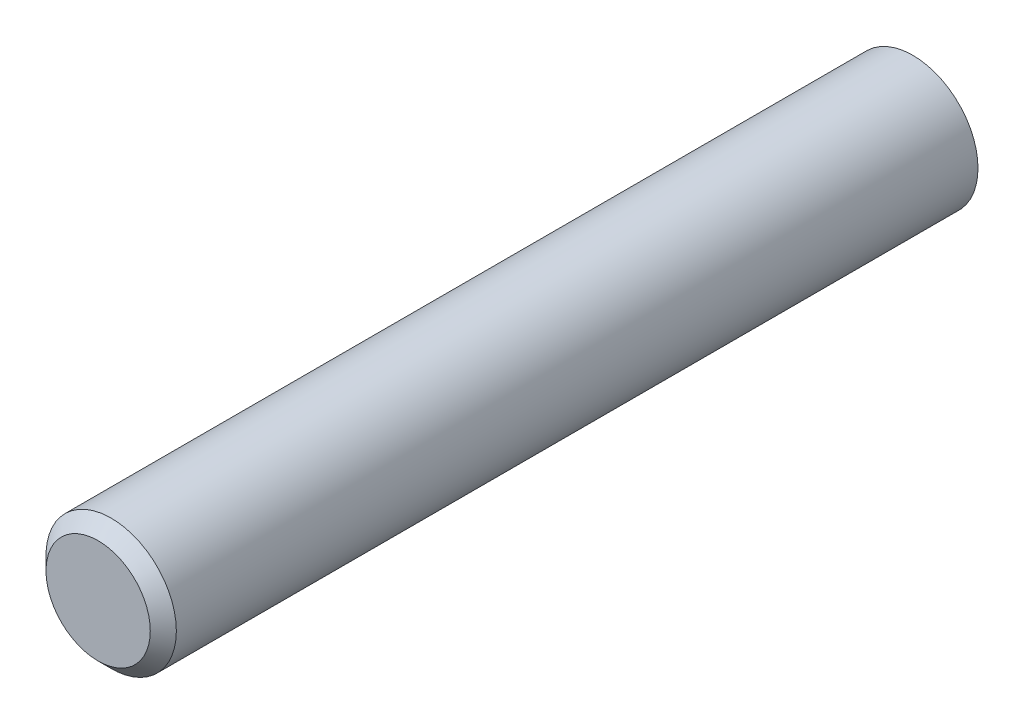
ISO-10303-21;
HEADER;
FILE_DESCRIPTION(('STEP AP214'),'2;1');
FILE_NAME('part.step','',(''),(''),'','','');
FILE_SCHEMA(('AUTOMOTIVE_DESIGN { 1 0 10303 214 1 1 1 1 }'));
ENDSEC;
DATA;
#1=APPLICATION_CONTEXT('core data for automotive mechanical design processes');
#2=APPLICATION_PROTOCOL_DEFINITION('international standard','automotive_design',2000,#1);
#3=PRODUCT_CONTEXT('',#1,'mechanical');
#4=PRODUCT('Part','Part','',(#3));
#5=PRODUCT_RELATED_PRODUCT_CATEGORY('part','',(#4));
#6=PRODUCT_DEFINITION_FORMATION('','',#4);
#7=PRODUCT_DEFINITION_CONTEXT('part definition',#1,'design');
#8=PRODUCT_DEFINITION('design','',#6,#7);
#9=PRODUCT_DEFINITION_SHAPE('','',#8);
#10=(LENGTH_UNIT() NAMED_UNIT(*) SI_UNIT(.MILLI.,.METRE.));
#11=(NAMED_UNIT(*) PLANE_ANGLE_UNIT() SI_UNIT($,.RADIAN.));
#12=(NAMED_UNIT(*) SI_UNIT($,.STERADIAN.) SOLID_ANGLE_UNIT());
#13=UNCERTAINTY_MEASURE_WITH_UNIT(LENGTH_MEASURE(1.E-05),#10,'distance_accuracy_value','');
#14=(GEOMETRIC_REPRESENTATION_CONTEXT(3) GLOBAL_UNCERTAINTY_ASSIGNED_CONTEXT((#13)) GLOBAL_UNIT_ASSIGNED_CONTEXT((#10,
#11,#12)) REPRESENTATION_CONTEXT('',''));
#15=CARTESIAN_POINT('',(0.,0.,0.));
#16=DIRECTION('',(0.,0.,1.));
#17=DIRECTION('',(1.,0.,0.));
#18=AXIS2_PLACEMENT_3D('',#15,#16,#17);
#19=CARTESIAN_POINT('',(0.,0.,25.));
#20=DIRECTION('',(0.,0.,-1.));
#21=DIRECTION('',(-1.,0.,0.));
#22=AXIS2_PLACEMENT_3D('',#19,#20,#21);
#23=CYLINDRICAL_SURFACE('',#22,4.);
#24=CARTESIAN_POINT('',(0.,0.,24.2));
#25=DIRECTION('',(0.,0.,1.));
#26=DIRECTION('',(1.,0.,0.));
#27=AXIS2_PLACEMENT_3D('',#24,#25,#26);
#28=CIRCLE('',#27,4.);
#29=CARTESIAN_POINT('',(4.,0.,24.2));
#30=VERTEX_POINT('',#29);
#31=EDGE_CURVE('E10',#30,#30,#28,.F.);
#32=ORIENTED_EDGE('',*,*,#31,.T.);
#33=EDGE_LOOP('',(#32));
#34=FACE_BOUND('',#33,.T.);
#35=CARTESIAN_POINT('',(0.,0.,-25.));
#36=DIRECTION('',(0.,0.,1.));
#37=DIRECTION('',(1.,0.,0.));
#38=AXIS2_PLACEMENT_3D('',#35,#36,#37);
#39=CIRCLE('',#38,4.);
#40=CARTESIAN_POINT('',(4.,0.,-25.));
#41=VERTEX_POINT('',#40);
#42=EDGE_CURVE('E41',#41,#41,#39,.T.);
#43=ORIENTED_EDGE('',*,*,#42,.T.);
#44=EDGE_LOOP('',(#43));
#45=FACE_BOUND('',#44,.T.);
#46=ADVANCED_FACE('F30',(#34,#45),#23,.T.);
#47=CARTESIAN_POINT('',(0.,0.,25.));
#48=DIRECTION('',(0.,0.,1.));
#49=DIRECTION('',(1.,0.,0.));
#50=AXIS2_PLACEMENT_3D('',#47,#48,#49);
#51=PLANE('',#50);
#52=CARTESIAN_POINT('',(0.,0.,25.));
#53=DIRECTION('',(0.,0.,1.));
#54=DIRECTION('',(1.,0.,0.));
#55=AXIS2_PLACEMENT_3D('',#52,#53,#54);
#56=CIRCLE('',#55,3.2);
#57=CARTESIAN_POINT('',(3.2,0.,25.));
#58=VERTEX_POINT('',#57);
#59=EDGE_CURVE('E37',#58,#58,#56,.T.);
#60=ORIENTED_EDGE('',*,*,#59,.T.);
#61=EDGE_LOOP('',(#60));
#62=FACE_BOUND('',#61,.T.);
#63=ADVANCED_FACE('F51',(#62),#51,.T.);
#64=CARTESIAN_POINT('',(0.,0.,-25.));
#65=DIRECTION('',(0.,0.,1.));
#66=DIRECTION('',(1.,0.,0.));
#67=AXIS2_PLACEMENT_3D('',#64,#65,#66);
#68=PLANE('',#67);
#69=ORIENTED_EDGE('',*,*,#42,.F.);
#70=EDGE_LOOP('',(#69));
#71=FACE_BOUND('',#70,.T.);
#72=ADVANCED_FACE('F49',(#71),#68,.F.);
#73=CARTESIAN_POINT('',(0.,0.,25.));
#74=DIRECTION('',(0.,0.,-1.));
#75=DIRECTION('',(-1.,0.,0.));
#76=AXIS2_PLACEMENT_3D('',#73,#74,#75);
#77=CONICAL_SURFACE('',#76,3.2,0.785398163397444);
#78=ORIENTED_EDGE('',*,*,#31,.F.);
#79=EDGE_LOOP('',(#78));
#80=FACE_BOUND('',#79,.T.);
#81=ORIENTED_EDGE('',*,*,#59,.F.);
#82=EDGE_LOOP('',(#81));
#83=FACE_BOUND('',#82,.T.);
#84=ADVANCED_FACE('F32',(#80,#83),#77,.T.);
#85=CLOSED_SHELL('',(#46,#63,#72,#84));
#86=MANIFOLD_SOLID_BREP('B2',#85);
#87=ADVANCED_BREP_SHAPE_REPRESENTATION('',(#18,#86),#14);
#88=SHAPE_DEFINITION_REPRESENTATION(#9,#87);
ENDSEC;
END-ISO-10303-21;
